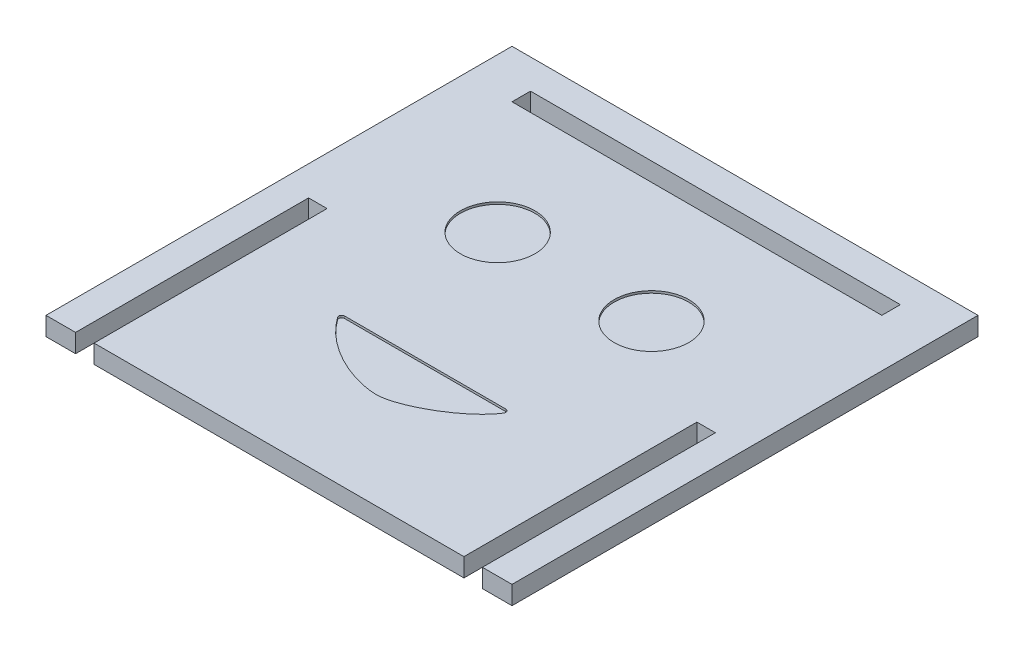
ISO-10303-21;
HEADER;
FILE_DESCRIPTION(('STEP AP214'),'2;1');
FILE_NAME('part.step','',(''),(''),'','','');
FILE_SCHEMA(('AUTOMOTIVE_DESIGN { 1 0 10303 214 1 1 1 1 }'));
ENDSEC;
DATA;
#1=APPLICATION_CONTEXT('core data for automotive mechanical design processes');
#2=APPLICATION_PROTOCOL_DEFINITION('international standard','automotive_design',2000,#1);
#3=PRODUCT_CONTEXT('',#1,'mechanical');
#4=PRODUCT('Part','Part','',(#3));
#5=PRODUCT_RELATED_PRODUCT_CATEGORY('part','',(#4));
#6=PRODUCT_DEFINITION_FORMATION('','',#4);
#7=PRODUCT_DEFINITION_CONTEXT('part definition',#1,'design');
#8=PRODUCT_DEFINITION('design','',#6,#7);
#9=PRODUCT_DEFINITION_SHAPE('','',#8);
#10=(LENGTH_UNIT() NAMED_UNIT(*) SI_UNIT(.MILLI.,.METRE.));
#11=(NAMED_UNIT(*) PLANE_ANGLE_UNIT() SI_UNIT($,.RADIAN.));
#12=(NAMED_UNIT(*) SI_UNIT($,.STERADIAN.) SOLID_ANGLE_UNIT());
#13=UNCERTAINTY_MEASURE_WITH_UNIT(LENGTH_MEASURE(1.E-05),#10,'distance_accuracy_value','');
#14=(GEOMETRIC_REPRESENTATION_CONTEXT(3) GLOBAL_UNCERTAINTY_ASSIGNED_CONTEXT((#13)) GLOBAL_UNIT_ASSIGNED_CONTEXT((#10,
#11,#12)) REPRESENTATION_CONTEXT('',''));
#15=CARTESIAN_POINT('',(0.,0.,0.));
#16=DIRECTION('',(0.,0.,1.));
#17=DIRECTION('',(1.,0.,0.));
#18=AXIS2_PLACEMENT_3D('',#15,#16,#17);
#19=CARTESIAN_POINT('',(27.5,2.5,31.5));
#20=DIRECTION('',(0.,0.,-1.));
#21=DIRECTION('',(-1.,0.,0.));
#22=AXIS2_PLACEMENT_3D('',#19,#20,#21);
#23=PLANE('',#22);
#24=DIRECTION('',(1.,0.,0.));
#25=VECTOR('',#24,1.);
#26=CARTESIAN_POINT('',(27.5,0.,31.5));
#27=LINE('',#26,#25);
#28=CARTESIAN_POINT('',(27.5,0.,31.5));
#29=VERTEX_POINT('',#28);
#30=CARTESIAN_POINT('',(31.5,0.,31.5));
#31=VERTEX_POINT('',#30);
#32=EDGE_CURVE('E325',#29,#31,#27,.T.);
#33=ORIENTED_EDGE('',*,*,#32,.T.);
#34=DIRECTION('',(0.,-1.,0.));
#35=VECTOR('',#34,1.);
#36=CARTESIAN_POINT('',(31.5,2.5,31.5));
#37=LINE('',#36,#35);
#38=CARTESIAN_POINT('',(31.5,2.5,31.5));
#39=VERTEX_POINT('',#38);
#40=EDGE_CURVE('E11',#39,#31,#37,.T.);
#41=ORIENTED_EDGE('',*,*,#40,.F.);
#42=DIRECTION('',(1.,0.,0.));
#43=VECTOR('',#42,1.);
#44=CARTESIAN_POINT('',(27.5,2.5,31.5));
#45=LINE('',#44,#43);
#46=CARTESIAN_POINT('',(27.5,2.5,31.5));
#47=VERTEX_POINT('',#46);
#48=EDGE_CURVE('E354',#47,#39,#45,.T.);
#49=ORIENTED_EDGE('',*,*,#48,.F.);
#50=DIRECTION('',(0.,-1.,0.));
#51=VECTOR('',#50,1.);
#52=CARTESIAN_POINT('',(27.5,2.5,31.5));
#53=LINE('',#52,#51);
#54=EDGE_CURVE('E355',#47,#29,#53,.T.);
#55=ORIENTED_EDGE('',*,*,#54,.T.);
#56=EDGE_LOOP('',(#33,#41,#49,#55));
#57=FACE_BOUND('',#56,.T.);
#58=ADVANCED_FACE('F34',(#57),#23,.F.);
#59=CARTESIAN_POINT('',(31.5,2.5,-31.5));
#60=DIRECTION('',(-1.,0.,0.));
#61=DIRECTION('',(0.,0.,1.));
#62=AXIS2_PLACEMENT_3D('',#59,#60,#61);
#63=PLANE('',#62);
#64=DIRECTION('',(0.,0.,-1.));
#65=VECTOR('',#64,1.);
#66=CARTESIAN_POINT('',(31.5,0.,-31.5));
#67=LINE('',#66,#65);
#68=CARTESIAN_POINT('',(31.5,0.,-31.5));
#69=VERTEX_POINT('',#68);
#70=EDGE_CURVE('E317',#31,#69,#67,.T.);
#71=ORIENTED_EDGE('',*,*,#70,.T.);
#72=DIRECTION('',(0.,-1.,0.));
#73=VECTOR('',#72,1.);
#74=CARTESIAN_POINT('',(31.5,2.5,-31.5));
#75=LINE('',#74,#73);
#76=CARTESIAN_POINT('',(31.5,2.5,-31.5));
#77=VERTEX_POINT('',#76);
#78=EDGE_CURVE('E41',#77,#69,#75,.T.);
#79=ORIENTED_EDGE('',*,*,#78,.F.);
#80=DIRECTION('',(0.,0.,-1.));
#81=VECTOR('',#80,1.);
#82=CARTESIAN_POINT('',(31.5,2.5,-31.5));
#83=LINE('',#82,#81);
#84=EDGE_CURVE('E392',#39,#77,#83,.T.);
#85=ORIENTED_EDGE('',*,*,#84,.F.);
#86=ORIENTED_EDGE('',*,*,#40,.T.);
#87=EDGE_LOOP('',(#71,#79,#85,#86));
#88=FACE_BOUND('',#87,.T.);
#89=ADVANCED_FACE('F308',(#88),#63,.F.);
#90=CARTESIAN_POINT('',(-31.5,2.5,-31.5));
#91=DIRECTION('',(0.,0.,1.));
#92=DIRECTION('',(1.,0.,0.));
#93=AXIS2_PLACEMENT_3D('',#90,#91,#92);
#94=PLANE('',#93);
#95=DIRECTION('',(-1.,0.,0.));
#96=VECTOR('',#95,1.);
#97=CARTESIAN_POINT('',(-31.5,0.,-31.5));
#98=LINE('',#97,#96);
#99=CARTESIAN_POINT('',(-31.5,0.,-31.5));
#100=VERTEX_POINT('',#99);
#101=EDGE_CURVE('E324',#69,#100,#98,.T.);
#102=ORIENTED_EDGE('',*,*,#101,.T.);
#103=DIRECTION('',(0.,-1.,0.));
#104=VECTOR('',#103,1.);
#105=CARTESIAN_POINT('',(-31.5,2.5,-31.5));
#106=LINE('',#105,#104);
#107=CARTESIAN_POINT('',(-31.5,2.5,-31.5));
#108=VERTEX_POINT('',#107);
#109=EDGE_CURVE('E330',#108,#100,#106,.T.);
#110=ORIENTED_EDGE('',*,*,#109,.F.);
#111=DIRECTION('',(-1.,0.,0.));
#112=VECTOR('',#111,1.);
#113=CARTESIAN_POINT('',(-31.5,2.5,-31.5));
#114=LINE('',#113,#112);
#115=EDGE_CURVE('E329',#77,#108,#114,.T.);
#116=ORIENTED_EDGE('',*,*,#115,.F.);
#117=ORIENTED_EDGE('',*,*,#78,.T.);
#118=EDGE_LOOP('',(#102,#110,#116,#117));
#119=FACE_BOUND('',#118,.T.);
#120=ADVANCED_FACE('F305',(#119),#94,.F.);
#121=CARTESIAN_POINT('',(-31.5,2.5,-31.5));
#122=DIRECTION('',(1.,0.,0.));
#123=DIRECTION('',(0.,0.,-1.));
#124=AXIS2_PLACEMENT_3D('',#121,#122,#123);
#125=PLANE('',#124);
#126=DIRECTION('',(0.,0.,1.));
#127=VECTOR('',#126,1.);
#128=CARTESIAN_POINT('',(-31.5,0.,-31.5));
#129=LINE('',#128,#127);
#130=CARTESIAN_POINT('',(-31.5,0.,31.5));
#131=VERTEX_POINT('',#130);
#132=EDGE_CURVE('E333',#100,#131,#129,.T.);
#133=ORIENTED_EDGE('',*,*,#132,.T.);
#134=DIRECTION('',(0.,-1.,0.));
#135=VECTOR('',#134,1.);
#136=CARTESIAN_POINT('',(-31.5,2.5,31.5));
#137=LINE('',#136,#135);
#138=CARTESIAN_POINT('',(-31.5,2.5,31.5));
#139=VERTEX_POINT('',#138);
#140=EDGE_CURVE('E380',#139,#131,#137,.T.);
#141=ORIENTED_EDGE('',*,*,#140,.F.);
#142=DIRECTION('',(0.,0.,1.));
#143=VECTOR('',#142,1.);
#144=CARTESIAN_POINT('',(-31.5,2.5,-31.5));
#145=LINE('',#144,#143);
#146=EDGE_CURVE('E385',#108,#139,#145,.T.);
#147=ORIENTED_EDGE('',*,*,#146,.F.);
#148=ORIENTED_EDGE('',*,*,#109,.T.);
#149=EDGE_LOOP('',(#133,#141,#147,#148));
#150=FACE_BOUND('',#149,.T.);
#151=ADVANCED_FACE('F301',(#150),#125,.F.);
#152=CARTESIAN_POINT('',(-31.5,2.5,31.5));
#153=DIRECTION('',(0.,0.,-1.));
#154=DIRECTION('',(-1.,0.,0.));
#155=AXIS2_PLACEMENT_3D('',#152,#153,#154);
#156=PLANE('',#155);
#157=DIRECTION('',(1.,0.,0.));
#158=VECTOR('',#157,1.);
#159=CARTESIAN_POINT('',(-31.5,0.,31.5));
#160=LINE('',#159,#158);
#161=CARTESIAN_POINT('',(-27.5,0.,31.5));
#162=VERTEX_POINT('',#161);
#163=EDGE_CURVE('E335',#131,#162,#160,.T.);
#164=ORIENTED_EDGE('',*,*,#163,.T.);
#165=DIRECTION('',(0.,-1.,0.));
#166=VECTOR('',#165,1.);
#167=CARTESIAN_POINT('',(-27.5,2.5,31.5));
#168=LINE('',#167,#166);
#169=CARTESIAN_POINT('',(-27.5,2.5,31.5));
#170=VERTEX_POINT('',#169);
#171=EDGE_CURVE('E377',#170,#162,#168,.T.);
#172=ORIENTED_EDGE('',*,*,#171,.F.);
#173=DIRECTION('',(1.,0.,0.));
#174=VECTOR('',#173,1.);
#175=CARTESIAN_POINT('',(-31.5,2.5,31.5));
#176=LINE('',#175,#174);
#177=EDGE_CURVE('E388',#139,#170,#176,.T.);
#178=ORIENTED_EDGE('',*,*,#177,.F.);
#179=ORIENTED_EDGE('',*,*,#140,.T.);
#180=EDGE_LOOP('',(#164,#172,#178,#179));
#181=FACE_BOUND('',#180,.T.);
#182=ADVANCED_FACE('F297',(#181),#156,.F.);
#183=CARTESIAN_POINT('',(-27.5,2.5,31.5));
#184=DIRECTION('',(-1.,0.,0.));
#185=DIRECTION('',(0.,0.,1.));
#186=AXIS2_PLACEMENT_3D('',#183,#184,#185);
#187=PLANE('',#186);
#188=DIRECTION('',(0.,0.,-1.));
#189=VECTOR('',#188,1.);
#190=CARTESIAN_POINT('',(-27.5,0.,31.5));
#191=LINE('',#190,#189);
#192=CARTESIAN_POINT('',(-27.5,0.,0.));
#193=VERTEX_POINT('',#192);
#194=EDGE_CURVE('E340',#162,#193,#191,.T.);
#195=ORIENTED_EDGE('',*,*,#194,.T.);
#196=DIRECTION('',(0.,-1.,0.));
#197=VECTOR('',#196,1.);
#198=CARTESIAN_POINT('',(-27.5,2.5,0.));
#199=LINE('',#198,#197);
#200=CARTESIAN_POINT('',(-27.5,2.5,0.));
#201=VERTEX_POINT('',#200);
#202=EDGE_CURVE('E374',#201,#193,#199,.T.);
#203=ORIENTED_EDGE('',*,*,#202,.F.);
#204=DIRECTION('',(0.,0.,-1.));
#205=VECTOR('',#204,1.);
#206=CARTESIAN_POINT('',(-27.5,2.5,31.5));
#207=LINE('',#206,#205);
#208=EDGE_CURVE('E390',#170,#201,#207,.T.);
#209=ORIENTED_EDGE('',*,*,#208,.F.);
#210=ORIENTED_EDGE('',*,*,#171,.T.);
#211=EDGE_LOOP('',(#195,#203,#209,#210));
#212=FACE_BOUND('',#211,.T.);
#213=ADVANCED_FACE('F293',(#212),#187,.F.);
#214=CARTESIAN_POINT('',(-27.5,2.5,0.));
#215=DIRECTION('',(0.,0.,-1.));
#216=DIRECTION('',(-1.,0.,0.));
#217=AXIS2_PLACEMENT_3D('',#214,#215,#216);
#218=PLANE('',#217);
#219=DIRECTION('',(1.,0.,0.));
#220=VECTOR('',#219,1.);
#221=CARTESIAN_POINT('',(-27.5,0.,0.));
#222=LINE('',#221,#220);
#223=CARTESIAN_POINT('',(-25.,0.,0.));
#224=VERTEX_POINT('',#223);
#225=EDGE_CURVE('E342',#193,#224,#222,.T.);
#226=ORIENTED_EDGE('',*,*,#225,.T.);
#227=DIRECTION('',(0.,-1.,0.));
#228=VECTOR('',#227,1.);
#229=CARTESIAN_POINT('',(-25.,2.5,0.));
#230=LINE('',#229,#228);
#231=CARTESIAN_POINT('',(-25.,2.5,0.));
#232=VERTEX_POINT('',#231);
#233=EDGE_CURVE('E371',#232,#224,#230,.T.);
#234=ORIENTED_EDGE('',*,*,#233,.F.);
#235=DIRECTION('',(1.,0.,0.));
#236=VECTOR('',#235,1.);
#237=CARTESIAN_POINT('',(-27.5,2.5,0.));
#238=LINE('',#237,#236);
#239=EDGE_CURVE('E397',#201,#232,#238,.T.);
#240=ORIENTED_EDGE('',*,*,#239,.F.);
#241=ORIENTED_EDGE('',*,*,#202,.T.);
#242=EDGE_LOOP('',(#226,#234,#240,#241));
#243=FACE_BOUND('',#242,.T.);
#244=ADVANCED_FACE('F289',(#243),#218,.F.);
#245=CARTESIAN_POINT('',(-25.,2.5,0.));
#246=DIRECTION('',(1.,0.,0.));
#247=DIRECTION('',(0.,0.,-1.));
#248=AXIS2_PLACEMENT_3D('',#245,#246,#247);
#249=PLANE('',#248);
#250=DIRECTION('',(0.,0.,1.));
#251=VECTOR('',#250,1.);
#252=CARTESIAN_POINT('',(-25.,0.,0.));
#253=LINE('',#252,#251);
#254=CARTESIAN_POINT('',(-25.,0.,31.5));
#255=VERTEX_POINT('',#254);
#256=EDGE_CURVE('E344',#224,#255,#253,.T.);
#257=ORIENTED_EDGE('',*,*,#256,.T.);
#258=DIRECTION('',(0.,-1.,0.));
#259=VECTOR('',#258,1.);
#260=CARTESIAN_POINT('',(-25.,2.5,31.5));
#261=LINE('',#260,#259);
#262=CARTESIAN_POINT('',(-25.,2.5,31.5));
#263=VERTEX_POINT('',#262);
#264=EDGE_CURVE('E368',#263,#255,#261,.T.);
#265=ORIENTED_EDGE('',*,*,#264,.F.);
#266=DIRECTION('',(0.,0.,1.));
#267=VECTOR('',#266,1.);
#268=CARTESIAN_POINT('',(-25.,2.5,0.));
#269=LINE('',#268,#267);
#270=EDGE_CURVE('E399',#232,#263,#269,.T.);
#271=ORIENTED_EDGE('',*,*,#270,.F.);
#272=ORIENTED_EDGE('',*,*,#233,.T.);
#273=EDGE_LOOP('',(#257,#265,#271,#272));
#274=FACE_BOUND('',#273,.T.);
#275=ADVANCED_FACE('F285',(#274),#249,.F.);
#276=CARTESIAN_POINT('',(-25.,2.5,31.5));
#277=DIRECTION('',(0.,0.,-1.));
#278=DIRECTION('',(-1.,0.,0.));
#279=AXIS2_PLACEMENT_3D('',#276,#277,#278);
#280=PLANE('',#279);
#281=DIRECTION('',(1.,0.,0.));
#282=VECTOR('',#281,1.);
#283=CARTESIAN_POINT('',(-25.,0.,31.5));
#284=LINE('',#283,#282);
#285=CARTESIAN_POINT('',(25.,0.,31.5));
#286=VERTEX_POINT('',#285);
#287=EDGE_CURVE('E346',#255,#286,#284,.T.);
#288=ORIENTED_EDGE('',*,*,#287,.T.);
#289=DIRECTION('',(0.,-1.,0.));
#290=VECTOR('',#289,1.);
#291=CARTESIAN_POINT('',(25.,2.5,31.5));
#292=LINE('',#291,#290);
#293=CARTESIAN_POINT('',(25.,2.5,31.5));
#294=VERTEX_POINT('',#293);
#295=EDGE_CURVE('E365',#294,#286,#292,.T.);
#296=ORIENTED_EDGE('',*,*,#295,.F.);
#297=DIRECTION('',(1.,0.,0.));
#298=VECTOR('',#297,1.);
#299=CARTESIAN_POINT('',(-25.,2.5,31.5));
#300=LINE('',#299,#298);
#301=EDGE_CURVE('E401',#263,#294,#300,.T.);
#302=ORIENTED_EDGE('',*,*,#301,.F.);
#303=ORIENTED_EDGE('',*,*,#264,.T.);
#304=EDGE_LOOP('',(#288,#296,#302,#303));
#305=FACE_BOUND('',#304,.T.);
#306=ADVANCED_FACE('F281',(#305),#280,.F.);
#307=CARTESIAN_POINT('',(25.,2.5,0.));
#308=DIRECTION('',(-1.,0.,0.));
#309=DIRECTION('',(0.,0.,1.));
#310=AXIS2_PLACEMENT_3D('',#307,#308,#309);
#311=PLANE('',#310);
#312=DIRECTION('',(0.,0.,-1.));
#313=VECTOR('',#312,1.);
#314=CARTESIAN_POINT('',(25.,0.,0.));
#315=LINE('',#314,#313);
#316=CARTESIAN_POINT('',(25.,0.,0.));
#317=VERTEX_POINT('',#316);
#318=EDGE_CURVE('E348',#286,#317,#315,.T.);
#319=ORIENTED_EDGE('',*,*,#318,.T.);
#320=DIRECTION('',(0.,-1.,0.));
#321=VECTOR('',#320,1.);
#322=CARTESIAN_POINT('',(25.,2.5,0.));
#323=LINE('',#322,#321);
#324=CARTESIAN_POINT('',(25.,2.5,0.));
#325=VERTEX_POINT('',#324);
#326=EDGE_CURVE('E362',#325,#317,#323,.T.);
#327=ORIENTED_EDGE('',*,*,#326,.F.);
#328=DIRECTION('',(0.,0.,-1.));
#329=VECTOR('',#328,1.);
#330=CARTESIAN_POINT('',(25.,2.5,0.));
#331=LINE('',#330,#329);
#332=EDGE_CURVE('E403',#294,#325,#331,.T.);
#333=ORIENTED_EDGE('',*,*,#332,.F.);
#334=ORIENTED_EDGE('',*,*,#295,.T.);
#335=EDGE_LOOP('',(#319,#327,#333,#334));
#336=FACE_BOUND('',#335,.T.);
#337=ADVANCED_FACE('F277',(#336),#311,.F.);
#338=CARTESIAN_POINT('',(27.5,2.5,0.));
#339=DIRECTION('',(0.,0.,-1.));
#340=DIRECTION('',(-1.,0.,0.));
#341=AXIS2_PLACEMENT_3D('',#338,#339,#340);
#342=PLANE('',#341);
#343=DIRECTION('',(1.,0.,0.));
#344=VECTOR('',#343,1.);
#345=CARTESIAN_POINT('',(27.5,0.,0.));
#346=LINE('',#345,#344);
#347=CARTESIAN_POINT('',(27.5,0.,0.));
#348=VERTEX_POINT('',#347);
#349=EDGE_CURVE('E350',#317,#348,#346,.T.);
#350=ORIENTED_EDGE('',*,*,#349,.T.);
#351=DIRECTION('',(0.,-1.,0.));
#352=VECTOR('',#351,1.);
#353=CARTESIAN_POINT('',(27.5,2.5,0.));
#354=LINE('',#353,#352);
#355=CARTESIAN_POINT('',(27.5,2.5,0.));
#356=VERTEX_POINT('',#355);
#357=EDGE_CURVE('E358',#356,#348,#354,.T.);
#358=ORIENTED_EDGE('',*,*,#357,.F.);
#359=DIRECTION('',(1.,0.,0.));
#360=VECTOR('',#359,1.);
#361=CARTESIAN_POINT('',(27.5,2.5,0.));
#362=LINE('',#361,#360);
#363=EDGE_CURVE('E405',#325,#356,#362,.T.);
#364=ORIENTED_EDGE('',*,*,#363,.F.);
#365=ORIENTED_EDGE('',*,*,#326,.T.);
#366=EDGE_LOOP('',(#350,#358,#364,#365));
#367=FACE_BOUND('',#366,.T.);
#368=ADVANCED_FACE('F273',(#367),#342,.F.);
#369=CARTESIAN_POINT('',(27.5,2.5,31.5));
#370=DIRECTION('',(1.,0.,0.));
#371=DIRECTION('',(0.,0.,-1.));
#372=AXIS2_PLACEMENT_3D('',#369,#370,#371);
#373=PLANE('',#372);
#374=DIRECTION('',(0.,0.,1.));
#375=VECTOR('',#374,1.);
#376=CARTESIAN_POINT('',(27.5,0.,31.5));
#377=LINE('',#376,#375);
#378=EDGE_CURVE('E352',#348,#29,#377,.T.);
#379=ORIENTED_EDGE('',*,*,#378,.T.);
#380=ORIENTED_EDGE('',*,*,#54,.F.);
#381=DIRECTION('',(0.,0.,1.));
#382=VECTOR('',#381,1.);
#383=CARTESIAN_POINT('',(27.5,2.5,31.5));
#384=LINE('',#383,#382);
#385=EDGE_CURVE('E359',#356,#47,#384,.T.);
#386=ORIENTED_EDGE('',*,*,#385,.F.);
#387=ORIENTED_EDGE('',*,*,#357,.T.);
#388=EDGE_LOOP('',(#379,#380,#386,#387));
#389=FACE_BOUND('',#388,.T.);
#390=ADVANCED_FACE('F267',(#389),#373,.F.);
#391=CARTESIAN_POINT('',(0.,2.5,0.));
#392=DIRECTION('',(0.,-1.,0.));
#393=DIRECTION('',(0.,0.,-1.));
#394=AXIS2_PLACEMENT_3D('',#391,#392,#393);
#395=PLANE('',#394);
#396=DIRECTION('',(1.,0.,0.));
#397=VECTOR('',#396,1.);
#398=CARTESIAN_POINT('',(-25.,2.5,-25.));
#399=LINE('',#398,#397);
#400=CARTESIAN_POINT('',(-25.,2.5,-25.));
#401=VERTEX_POINT('',#400);
#402=CARTESIAN_POINT('',(25.,2.5,-25.));
#403=VERTEX_POINT('',#402);
#404=EDGE_CURVE('E197',#401,#403,#399,.T.);
#405=ORIENTED_EDGE('',*,*,#404,.F.);
#406=DIRECTION('',(0.,0.,1.));
#407=VECTOR('',#406,1.);
#408=CARTESIAN_POINT('',(-25.,2.5,-25.));
#409=LINE('',#408,#407);
#410=CARTESIAN_POINT('',(-25.,2.5,-27.5));
#411=VERTEX_POINT('',#410);
#412=EDGE_CURVE('E48',#411,#401,#409,.T.);
#413=ORIENTED_EDGE('',*,*,#412,.F.);
#414=DIRECTION('',(-1.,0.,0.));
#415=VECTOR('',#414,1.);
#416=CARTESIAN_POINT('',(-25.,2.5,-27.5));
#417=LINE('',#416,#415);
#418=CARTESIAN_POINT('',(25.,2.5,-27.5));
#419=VERTEX_POINT('',#418);
#420=EDGE_CURVE('E188',#419,#411,#417,.T.);
#421=ORIENTED_EDGE('',*,*,#420,.F.);
#422=DIRECTION('',(0.,0.,-1.));
#423=VECTOR('',#422,1.);
#424=CARTESIAN_POINT('',(25.,2.5,-25.));
#425=LINE('',#424,#423);
#426=EDGE_CURVE('E191',#403,#419,#425,.T.);
#427=ORIENTED_EDGE('',*,*,#426,.F.);
#428=EDGE_LOOP('',(#405,#413,#421,#427));
#429=FACE_BOUND('',#428,.T.);
#430=DIRECTION('',(-1.,0.,0.));
#431=VECTOR('',#430,1.);
#432=CARTESIAN_POINT('',(-11.2362411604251,2.5,11.3923140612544));
#433=LINE('',#432,#431);
#434=CARTESIAN_POINT('',(10.5434034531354,2.5,11.3923140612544));
#435=VERTEX_POINT('',#434);
#436=CARTESIAN_POINT('',(-11.2362411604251,2.5,11.3923140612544));
#437=VERTEX_POINT('',#436);
#438=EDGE_CURVE('E463',#435,#437,#433,.T.);
#439=ORIENTED_EDGE('',*,*,#438,.F.);
#440=CARTESIAN_POINT('',(10.5434034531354,2.5,11.7923140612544));
#441=DIRECTION('',(0.,1.,0.));
#442=DIRECTION('',(0.,0.,-1.));
#443=AXIS2_PLACEMENT_3D('',#440,#441,#442);
#444=CIRCLE('',#443,0.399999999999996);
#445=CARTESIAN_POINT('',(10.8841825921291,2.5,12.0017647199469));
#446=VERTEX_POINT('',#445);
#447=EDGE_CURVE('E203',#446,#435,#444,.T.);
#448=ORIENTED_EDGE('',*,*,#447,.F.);
#449=CARTESIAN_POINT('',(-11.5607544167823,2.5,12.0261754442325));
#450=CARTESIAN_POINT('',(-8.7109056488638,2.5,15.9807133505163));
#451=CARTESIAN_POINT('',(-3.12681868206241,2.5,18.3729241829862));
#452=CARTESIAN_POINT('',(2.80262271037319,2.5,18.5850192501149));
#453=CARTESIAN_POINT('',(9.13778316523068,2.5,14.843180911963));
#454=CARTESIAN_POINT('',(10.8841825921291,2.5,12.0017647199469));
#455=B_SPLINE_CURVE_WITH_KNOTS('',3,(#449,#450,#451,#452,#453,#454),.UNSPECIFIED.,.F.,.F.,(4,1,
1,4),(0.0230952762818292,0.468250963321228,0.563083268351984,0.97141832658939),.UNSPECIFIED.);
#456=CARTESIAN_POINT('',(-11.5607544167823,2.5,12.0261754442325));
#457=VERTEX_POINT('',#456);
#458=EDGE_CURVE('E211',#457,#446,#455,.T.);
#459=ORIENTED_EDGE('',*,*,#458,.F.);
#460=CARTESIAN_POINT('',(-11.2362411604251,2.5,11.7923140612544));
#461=DIRECTION('',(0.,1.,0.));
#462=DIRECTION('',(0.,0.,1.));
#463=AXIS2_PLACEMENT_3D('',#460,#461,#462);
#464=CIRCLE('',#463,0.399999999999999);
#465=EDGE_CURVE('E458',#437,#457,#464,.T.);
#466=ORIENTED_EDGE('',*,*,#465,.F.);
#467=EDGE_LOOP('',(#439,#448,#459,#466));
#468=FACE_BOUND('',#467,.T.);
#469=CARTESIAN_POINT('',(10.1002839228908,2.5,-8.75509040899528));
#470=DIRECTION('',(0.,1.,0.));
#471=DIRECTION('',(0.,0.,1.));
#472=AXIS2_PLACEMENT_3D('',#469,#470,#471);
#473=CIRCLE('',#472,5.04132021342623);
#474=CARTESIAN_POINT('',(10.1002839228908,2.5,-3.71377019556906));
#475=VERTEX_POINT('',#474);
#476=EDGE_CURVE('E416',#475,#475,#473,.T.);
#477=ORIENTED_EDGE('',*,*,#476,.F.);
#478=EDGE_LOOP('',(#477));
#479=FACE_BOUND('',#478,.T.);
#480=CARTESIAN_POINT('',(-10.6941010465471,2.5,-8.75509040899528));
#481=DIRECTION('',(0.,1.,0.));
#482=DIRECTION('',(0.,0.,1.));
#483=AXIS2_PLACEMENT_3D('',#480,#481,#482);
#484=CIRCLE('',#483,5.04132021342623);
#485=CARTESIAN_POINT('',(-10.6941010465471,2.5,-3.71377019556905));
#486=VERTEX_POINT('',#485);
#487=EDGE_CURVE('E409',#486,#486,#484,.T.);
#488=ORIENTED_EDGE('',*,*,#487,.F.);
#489=EDGE_LOOP('',(#488));
#490=FACE_BOUND('',#489,.T.);
#491=ORIENTED_EDGE('',*,*,#48,.T.);
#492=ORIENTED_EDGE('',*,*,#84,.T.);
#493=ORIENTED_EDGE('',*,*,#115,.T.);
#494=ORIENTED_EDGE('',*,*,#146,.T.);
#495=ORIENTED_EDGE('',*,*,#177,.T.);
#496=ORIENTED_EDGE('',*,*,#208,.T.);
#497=ORIENTED_EDGE('',*,*,#239,.T.);
#498=ORIENTED_EDGE('',*,*,#270,.T.);
#499=ORIENTED_EDGE('',*,*,#301,.T.);
#500=ORIENTED_EDGE('',*,*,#332,.T.);
#501=ORIENTED_EDGE('',*,*,#363,.T.);
#502=ORIENTED_EDGE('',*,*,#385,.T.);
#503=EDGE_LOOP('',(#491,#492,#493,#494,#495,#496,#497,#498,#499,#500,#501,#502));
#504=FACE_BOUND('',#503,.T.);
#505=ADVANCED_FACE('F264',(#429,#468,#479,#490,#504),#395,.F.);
#506=CARTESIAN_POINT('',(0.,0.,0.));
#507=DIRECTION('',(0.,-1.,0.));
#508=DIRECTION('',(0.,0.,-1.));
#509=AXIS2_PLACEMENT_3D('',#506,#507,#508);
#510=PLANE('',#509);
#511=DIRECTION('',(0.,0.,1.));
#512=VECTOR('',#511,1.);
#513=CARTESIAN_POINT('',(-25.,0.,-25.));
#514=LINE('',#513,#512);
#515=CARTESIAN_POINT('',(-25.,0.,-27.5));
#516=VERTEX_POINT('',#515);
#517=CARTESIAN_POINT('',(-25.,0.,-25.));
#518=VERTEX_POINT('',#517);
#519=EDGE_CURVE('E172',#516,#518,#514,.T.);
#520=ORIENTED_EDGE('',*,*,#519,.T.);
#521=DIRECTION('',(1.,0.,0.));
#522=VECTOR('',#521,1.);
#523=CARTESIAN_POINT('',(-25.,0.,-25.));
#524=LINE('',#523,#522);
#525=CARTESIAN_POINT('',(25.,0.,-25.));
#526=VERTEX_POINT('',#525);
#527=EDGE_CURVE('E181',#518,#526,#524,.T.);
#528=ORIENTED_EDGE('',*,*,#527,.T.);
#529=DIRECTION('',(0.,0.,-1.));
#530=VECTOR('',#529,1.);
#531=CARTESIAN_POINT('',(25.,0.,-25.));
#532=LINE('',#531,#530);
#533=CARTESIAN_POINT('',(25.,0.,-27.5));
#534=VERTEX_POINT('',#533);
#535=EDGE_CURVE('E56',#526,#534,#532,.T.);
#536=ORIENTED_EDGE('',*,*,#535,.T.);
#537=DIRECTION('',(-1.,0.,0.));
#538=VECTOR('',#537,1.);
#539=CARTESIAN_POINT('',(-25.,0.,-27.5));
#540=LINE('',#539,#538);
#541=EDGE_CURVE('E178',#534,#516,#540,.T.);
#542=ORIENTED_EDGE('',*,*,#541,.T.);
#543=EDGE_LOOP('',(#520,#528,#536,#542));
#544=FACE_BOUND('',#543,.T.);
#545=ORIENTED_EDGE('',*,*,#32,.F.);
#546=ORIENTED_EDGE('',*,*,#378,.F.);
#547=ORIENTED_EDGE('',*,*,#349,.F.);
#548=ORIENTED_EDGE('',*,*,#318,.F.);
#549=ORIENTED_EDGE('',*,*,#287,.F.);
#550=ORIENTED_EDGE('',*,*,#256,.F.);
#551=ORIENTED_EDGE('',*,*,#225,.F.);
#552=ORIENTED_EDGE('',*,*,#194,.F.);
#553=ORIENTED_EDGE('',*,*,#163,.F.);
#554=ORIENTED_EDGE('',*,*,#132,.F.);
#555=ORIENTED_EDGE('',*,*,#101,.F.);
#556=ORIENTED_EDGE('',*,*,#70,.F.);
#557=EDGE_LOOP('',(#545,#546,#547,#548,#549,#550,#551,#552,#553,#554,#555,#556));
#558=FACE_BOUND('',#557,.T.);
#559=ADVANCED_FACE('F185',(#544,#558),#510,.T.);
#560=CARTESIAN_POINT('',(-10.6941010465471,2.2,-8.75509040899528));
#561=DIRECTION('',(0.,1.,0.));
#562=DIRECTION('',(0.,0.,1.));
#563=AXIS2_PLACEMENT_3D('',#560,#561,#562);
#564=CYLINDRICAL_SURFACE('',#563,5.04132021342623);
#565=CARTESIAN_POINT('',(-10.6941010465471,2.2,-8.75509040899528));
#566=DIRECTION('',(0.,1.,0.));
#567=DIRECTION('',(0.,0.,1.));
#568=AXIS2_PLACEMENT_3D('',#565,#566,#567);
#569=CIRCLE('',#568,5.04132021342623);
#570=CARTESIAN_POINT('',(-10.6941010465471,2.2,-3.71377019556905));
#571=VERTEX_POINT('',#570);
#572=EDGE_CURVE('E407',#571,#571,#569,.T.);
#573=ORIENTED_EDGE('',*,*,#572,.F.);
#574=EDGE_LOOP('',(#573));
#575=FACE_BOUND('',#574,.T.);
#576=ORIENTED_EDGE('',*,*,#487,.T.);
#577=EDGE_LOOP('',(#576));
#578=FACE_BOUND('',#577,.T.);
#579=ADVANCED_FACE('F259',(#575,#578),#564,.F.);
#580=CARTESIAN_POINT('',(-10.6941010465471,2.2,-8.75509040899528));
#581=DIRECTION('',(0.,1.,0.));
#582=DIRECTION('',(0.,0.,1.));
#583=AXIS2_PLACEMENT_3D('',#580,#581,#582);
#584=PLANE('',#583);
#585=ORIENTED_EDGE('',*,*,#572,.T.);
#586=EDGE_LOOP('',(#585));
#587=FACE_BOUND('',#586,.T.);
#588=ADVANCED_FACE('F255',(#587),#584,.T.);
#589=CARTESIAN_POINT('',(10.1002839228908,2.2,-8.75509040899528));
#590=DIRECTION('',(0.,1.,0.));
#591=DIRECTION('',(0.,0.,1.));
#592=AXIS2_PLACEMENT_3D('',#589,#590,#591);
#593=CYLINDRICAL_SURFACE('',#592,5.04132021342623);
#594=CARTESIAN_POINT('',(10.1002839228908,2.2,-8.75509040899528));
#595=DIRECTION('',(0.,1.,0.));
#596=DIRECTION('',(0.,0.,1.));
#597=AXIS2_PLACEMENT_3D('',#594,#595,#596);
#598=CIRCLE('',#597,5.04132021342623);
#599=CARTESIAN_POINT('',(10.1002839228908,2.2,-3.71377019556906));
#600=VERTEX_POINT('',#599);
#601=EDGE_CURVE('E413',#600,#600,#598,.T.);
#602=ORIENTED_EDGE('',*,*,#601,.F.);
#603=EDGE_LOOP('',(#602));
#604=FACE_BOUND('',#603,.T.);
#605=ORIENTED_EDGE('',*,*,#476,.T.);
#606=EDGE_LOOP('',(#605));
#607=FACE_BOUND('',#606,.T.);
#608=ADVANCED_FACE('F251',(#604,#607),#593,.F.);
#609=CARTESIAN_POINT('',(10.1002839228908,2.2,-8.75509040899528));
#610=DIRECTION('',(0.,1.,0.));
#611=DIRECTION('',(0.,0.,1.));
#612=AXIS2_PLACEMENT_3D('',#609,#610,#611);
#613=PLANE('',#612);
#614=ORIENTED_EDGE('',*,*,#601,.T.);
#615=EDGE_LOOP('',(#614));
#616=FACE_BOUND('',#615,.T.);
#617=ADVANCED_FACE('F247',(#616),#613,.T.);
#618=CARTESIAN_POINT('',(10.5434034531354,2.2,11.7923140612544));
#619=DIRECTION('',(0.,1.,0.));
#620=DIRECTION('',(0.,0.,1.));
#621=AXIS2_PLACEMENT_3D('',#618,#619,#620);
#622=CYLINDRICAL_SURFACE('',#621,0.399999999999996);
#623=ORIENTED_EDGE('',*,*,#447,.T.);
#624=DIRECTION('',(0.,1.,0.));
#625=VECTOR('',#624,1.);
#626=CARTESIAN_POINT('',(10.5434034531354,2.2,11.3923140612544));
#627=LINE('',#626,#625);
#628=CARTESIAN_POINT('',(10.5434034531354,2.2,11.3923140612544));
#629=VERTEX_POINT('',#628);
#630=EDGE_CURVE('E223',#629,#435,#627,.T.);
#631=ORIENTED_EDGE('',*,*,#630,.F.);
#632=CARTESIAN_POINT('',(10.5434034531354,2.2,11.7923140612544));
#633=DIRECTION('',(0.,1.,0.));
#634=DIRECTION('',(0.,0.,-1.));
#635=AXIS2_PLACEMENT_3D('',#632,#633,#634);
#636=CIRCLE('',#635,0.399999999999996);
#637=CARTESIAN_POINT('',(10.8841825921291,2.2,12.0017647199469));
#638=VERTEX_POINT('',#637);
#639=EDGE_CURVE('E207',#638,#629,#636,.T.);
#640=ORIENTED_EDGE('',*,*,#639,.F.);
#641=DIRECTION('',(0.,1.,0.));
#642=VECTOR('',#641,1.);
#643=CARTESIAN_POINT('',(10.8841825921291,2.2,12.0017647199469));
#644=LINE('',#643,#642);
#645=EDGE_CURVE('E444',#638,#446,#644,.T.);
#646=ORIENTED_EDGE('',*,*,#645,.T.);
#647=EDGE_LOOP('',(#623,#631,#640,#646));
#648=FACE_BOUND('',#647,.T.);
#649=ADVANCED_FACE('F234',(#648),#622,.F.);
#650=CARTESIAN_POINT('',(-11.5607544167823,2.2,12.0261754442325));
#651=CARTESIAN_POINT('',(-8.7109056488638,2.2,15.9807133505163));
#652=CARTESIAN_POINT('',(-3.12681868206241,2.2,18.3729241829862));
#653=CARTESIAN_POINT('',(2.80262271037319,2.2,18.5850192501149));
#654=CARTESIAN_POINT('',(9.13778316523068,2.2,14.843180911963));
#655=CARTESIAN_POINT('',(10.8841825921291,2.2,12.0017647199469));
#656=B_SPLINE_CURVE_WITH_KNOTS('',3,(#650,#651,#652,#653,#654,#655),.UNSPECIFIED.,.F.,.F.,(4,1,
1,4),(0.0230952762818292,0.468250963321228,0.563083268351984,0.97141832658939),.UNSPECIFIED.);
#657=DIRECTION('',(0.,1.,0.));
#658=VECTOR('',#657,1.);
#659=SURFACE_OF_LINEAR_EXTRUSION('',#656,#658);
#660=ORIENTED_EDGE('',*,*,#458,.T.);
#661=ORIENTED_EDGE('',*,*,#645,.F.);
#662=CARTESIAN_POINT('',(-11.5607544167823,2.2,12.0261754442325));
#663=VERTEX_POINT('',#662);
#664=EDGE_CURVE('E217',#663,#638,#656,.T.);
#665=ORIENTED_EDGE('',*,*,#664,.F.);
#666=DIRECTION('',(0.,1.,0.));
#667=VECTOR('',#666,1.);
#668=CARTESIAN_POINT('',(-11.5607544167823,2.2,12.0261754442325));
#669=LINE('',#668,#667);
#670=EDGE_CURVE('E451',#663,#457,#669,.T.);
#671=ORIENTED_EDGE('',*,*,#670,.T.);
#672=EDGE_LOOP('',(#660,#661,#665,#671));
#673=FACE_BOUND('',#672,.T.);
#674=ADVANCED_FACE('F229',(#673),#659,.F.);
#675=CARTESIAN_POINT('',(-11.2362411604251,2.2,11.7923140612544));
#676=DIRECTION('',(0.,1.,0.));
#677=DIRECTION('',(0.,0.,1.));
#678=AXIS2_PLACEMENT_3D('',#675,#676,#677);
#679=CYLINDRICAL_SURFACE('',#678,0.399999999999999);
#680=ORIENTED_EDGE('',*,*,#465,.T.);
#681=ORIENTED_EDGE('',*,*,#670,.F.);
#682=CARTESIAN_POINT('',(-11.2362411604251,2.2,11.7923140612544));
#683=DIRECTION('',(0.,1.,0.));
#684=DIRECTION('',(0.,0.,1.));
#685=AXIS2_PLACEMENT_3D('',#682,#683,#684);
#686=CIRCLE('',#685,0.399999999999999);
#687=CARTESIAN_POINT('',(-11.2362411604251,2.2,11.3923140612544));
#688=VERTEX_POINT('',#687);
#689=EDGE_CURVE('E214',#688,#663,#686,.T.);
#690=ORIENTED_EDGE('',*,*,#689,.F.);
#691=DIRECTION('',(0.,1.,0.));
#692=VECTOR('',#691,1.);
#693=CARTESIAN_POINT('',(-11.2362411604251,2.2,11.3923140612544));
#694=LINE('',#693,#692);
#695=EDGE_CURVE('E449',#688,#437,#694,.T.);
#696=ORIENTED_EDGE('',*,*,#695,.T.);
#697=EDGE_LOOP('',(#680,#681,#690,#696));
#698=FACE_BOUND('',#697,.T.);
#699=ADVANCED_FACE('F233',(#698),#679,.F.);
#700=CARTESIAN_POINT('',(-11.2362411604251,2.2,11.3923140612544));
#701=DIRECTION('',(0.,0.,-1.));
#702=DIRECTION('',(-1.,0.,0.));
#703=AXIS2_PLACEMENT_3D('',#700,#701,#702);
#704=PLANE('',#703);
#705=ORIENTED_EDGE('',*,*,#438,.T.);
#706=ORIENTED_EDGE('',*,*,#695,.F.);
#707=DIRECTION('',(-1.,0.,0.));
#708=VECTOR('',#707,1.);
#709=CARTESIAN_POINT('',(-11.2362411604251,2.2,11.3923140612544));
#710=LINE('',#709,#708);
#711=EDGE_CURVE('E210',#629,#688,#710,.T.);
#712=ORIENTED_EDGE('',*,*,#711,.F.);
#713=ORIENTED_EDGE('',*,*,#630,.T.);
#714=EDGE_LOOP('',(#705,#706,#712,#713));
#715=FACE_BOUND('',#714,.T.);
#716=ADVANCED_FACE('F240',(#715),#704,.F.);
#717=CARTESIAN_POINT('',(10.5434034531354,2.2,11.7923140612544));
#718=DIRECTION('',(0.,-1.,0.));
#719=DIRECTION('',(0.,0.,-1.));
#720=AXIS2_PLACEMENT_3D('',#717,#718,#719);
#721=PLANE('',#720);
#722=ORIENTED_EDGE('',*,*,#639,.T.);
#723=ORIENTED_EDGE('',*,*,#711,.T.);
#724=ORIENTED_EDGE('',*,*,#689,.T.);
#725=ORIENTED_EDGE('',*,*,#664,.T.);
#726=EDGE_LOOP('',(#722,#723,#724,#725));
#727=FACE_BOUND('',#726,.T.);
#728=ADVANCED_FACE('F236',(#727),#721,.F.);
#729=CARTESIAN_POINT('',(-25.,0.,-25.));
#730=DIRECTION('',(-1.,0.,0.));
#731=DIRECTION('',(0.,0.,1.));
#732=AXIS2_PLACEMENT_3D('',#729,#730,#731);
#733=PLANE('',#732);
#734=ORIENTED_EDGE('',*,*,#412,.T.);
#735=DIRECTION('',(0.,1.,0.));
#736=VECTOR('',#735,1.);
#737=CARTESIAN_POINT('',(-25.,0.,-25.));
#738=LINE('',#737,#736);
#739=EDGE_CURVE('E168',#518,#401,#738,.T.);
#740=ORIENTED_EDGE('',*,*,#739,.F.);
#741=ORIENTED_EDGE('',*,*,#519,.F.);
#742=DIRECTION('',(0.,1.,0.));
#743=VECTOR('',#742,1.);
#744=CARTESIAN_POINT('',(-25.,0.,-27.5));
#745=LINE('',#744,#743);
#746=EDGE_CURVE('E201',#516,#411,#745,.T.);
#747=ORIENTED_EDGE('',*,*,#746,.T.);
#748=EDGE_LOOP('',(#734,#740,#741,#747));
#749=FACE_BOUND('',#748,.T.);
#750=ADVANCED_FACE('F170',(#749),#733,.F.);
#751=CARTESIAN_POINT('',(-25.,0.,-27.5));
#752=DIRECTION('',(0.,0.,-1.));
#753=DIRECTION('',(-1.,0.,0.));
#754=AXIS2_PLACEMENT_3D('',#751,#752,#753);
#755=PLANE('',#754);
#756=ORIENTED_EDGE('',*,*,#420,.T.);
#757=ORIENTED_EDGE('',*,*,#746,.F.);
#758=ORIENTED_EDGE('',*,*,#541,.F.);
#759=DIRECTION('',(0.,1.,0.));
#760=VECTOR('',#759,1.);
#761=CARTESIAN_POINT('',(25.,0.,-27.5));
#762=LINE('',#761,#760);
#763=EDGE_CURVE('E204',#534,#419,#762,.T.);
#764=ORIENTED_EDGE('',*,*,#763,.T.);
#765=EDGE_LOOP('',(#756,#757,#758,#764));
#766=FACE_BOUND('',#765,.T.);
#767=ADVANCED_FACE('F480',(#766),#755,.F.);
#768=CARTESIAN_POINT('',(25.,0.,-25.));
#769=DIRECTION('',(1.,0.,0.));
#770=DIRECTION('',(0.,0.,-1.));
#771=AXIS2_PLACEMENT_3D('',#768,#769,#770);
#772=PLANE('',#771);
#773=ORIENTED_EDGE('',*,*,#426,.T.);
#774=ORIENTED_EDGE('',*,*,#763,.F.);
#775=ORIENTED_EDGE('',*,*,#535,.F.);
#776=DIRECTION('',(0.,1.,0.));
#777=VECTOR('',#776,1.);
#778=CARTESIAN_POINT('',(25.,0.,-25.));
#779=LINE('',#778,#777);
#780=EDGE_CURVE('E177',#526,#403,#779,.T.);
#781=ORIENTED_EDGE('',*,*,#780,.T.);
#782=EDGE_LOOP('',(#773,#774,#775,#781));
#783=FACE_BOUND('',#782,.T.);
#784=ADVANCED_FACE('F484',(#783),#772,.F.);
#785=CARTESIAN_POINT('',(-25.,0.,-25.));
#786=DIRECTION('',(0.,0.,1.));
#787=DIRECTION('',(1.,0.,0.));
#788=AXIS2_PLACEMENT_3D('',#785,#786,#787);
#789=PLANE('',#788);
#790=ORIENTED_EDGE('',*,*,#404,.T.);
#791=ORIENTED_EDGE('',*,*,#780,.F.);
#792=ORIENTED_EDGE('',*,*,#527,.F.);
#793=ORIENTED_EDGE('',*,*,#739,.T.);
#794=EDGE_LOOP('',(#790,#791,#792,#793));
#795=FACE_BOUND('',#794,.T.);
#796=ADVANCED_FACE('F182',(#795),#789,.F.);
#797=CLOSED_SHELL('',(#58,#89,#120,#151,#182,#213,#244,#275,#306,#337,#368,#390,#505,#559,#579,
#588,#608,#617,#649,#674,#699,#716,#728,#750,#767,#784,#796));
#798=MANIFOLD_SOLID_BREP('B2',#797);
#799=ADVANCED_BREP_SHAPE_REPRESENTATION('',(#18,#798),#14);
#800=SHAPE_DEFINITION_REPRESENTATION(#9,#799);
ENDSEC;
END-ISO-10303-21;
